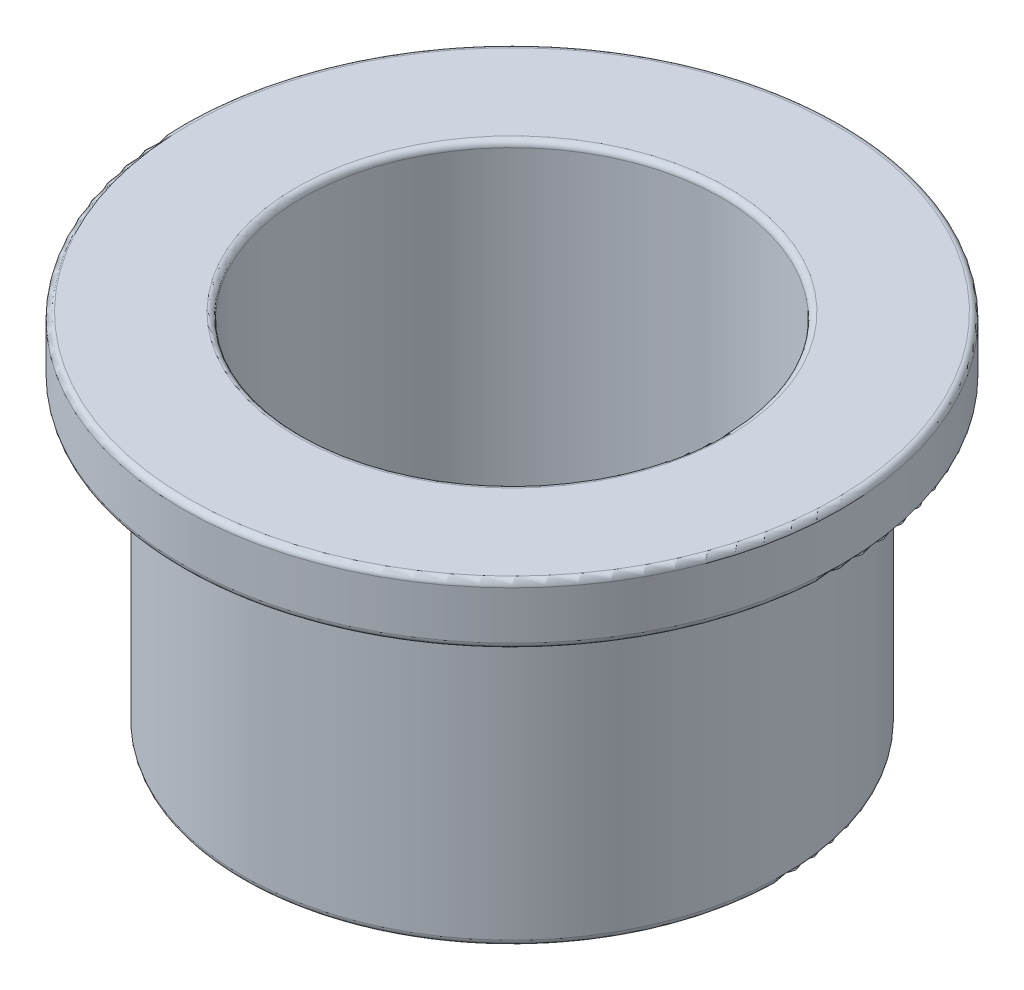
ISO-10303-21;
HEADER;
FILE_DESCRIPTION(('STEP AP214'),'2;1');
FILE_NAME('part.step','',(''),(''),'','','');
FILE_SCHEMA(('AUTOMOTIVE_DESIGN { 1 0 10303 214 1 1 1 1 }'));
ENDSEC;
DATA;
#1=APPLICATION_CONTEXT('core data for automotive mechanical design processes');
#2=APPLICATION_PROTOCOL_DEFINITION('international standard','automotive_design',2000,#1);
#3=PRODUCT_CONTEXT('',#1,'mechanical');
#4=PRODUCT('Part','Part','',(#3));
#5=PRODUCT_RELATED_PRODUCT_CATEGORY('part','',(#4));
#6=PRODUCT_DEFINITION_FORMATION('','',#4);
#7=PRODUCT_DEFINITION_CONTEXT('part definition',#1,'design');
#8=PRODUCT_DEFINITION('design','',#6,#7);
#9=PRODUCT_DEFINITION_SHAPE('','',#8);
#10=(LENGTH_UNIT() NAMED_UNIT(*) SI_UNIT(.MILLI.,.METRE.));
#11=(NAMED_UNIT(*) PLANE_ANGLE_UNIT() SI_UNIT($,.RADIAN.));
#12=(NAMED_UNIT(*) SI_UNIT($,.STERADIAN.) SOLID_ANGLE_UNIT());
#13=UNCERTAINTY_MEASURE_WITH_UNIT(LENGTH_MEASURE(1.E-05),#10,'distance_accuracy_value','');
#14=(GEOMETRIC_REPRESENTATION_CONTEXT(3) GLOBAL_UNCERTAINTY_ASSIGNED_CONTEXT((#13)) GLOBAL_UNIT_ASSIGNED_CONTEXT((#10,
#11,#12)) REPRESENTATION_CONTEXT('',''));
#15=CARTESIAN_POINT('',(0.,0.,0.));
#16=DIRECTION('',(0.,0.,1.));
#17=DIRECTION('',(1.,0.,0.));
#18=AXIS2_PLACEMENT_3D('',#15,#16,#17);
#19=CARTESIAN_POINT('',(9.,0.,0.));
#20=DIRECTION('',(0.,-1.,0.));
#21=DIRECTION('',(0.,0.,-1.));
#22=AXIS2_PLACEMENT_3D('',#19,#20,#21);
#23=PLANE('',#22);
#24=CARTESIAN_POINT('',(0.,0.,0.));
#25=DIRECTION('',(0.,-1.,0.));
#26=DIRECTION('',(0.,0.,-1.));
#27=AXIS2_PLACEMENT_3D('',#24,#25,#26);
#28=CIRCLE('',#27,7.2);
#29=CARTESIAN_POINT('',(0.,0.,-7.2));
#30=VERTEX_POINT('',#29);
#31=EDGE_CURVE('E61',#30,#30,#28,.F.);
#32=ORIENTED_EDGE('',*,*,#31,.T.);
#33=EDGE_LOOP('',(#32));
#34=FACE_BOUND('',#33,.T.);
#35=CARTESIAN_POINT('',(0.,0.,0.));
#36=DIRECTION('',(0.,-1.,0.));
#37=DIRECTION('',(0.,0.,-1.));
#38=AXIS2_PLACEMENT_3D('',#35,#36,#37);
#39=CIRCLE('',#38,8.8);
#40=CARTESIAN_POINT('',(0.,0.,-8.8));
#41=VERTEX_POINT('',#40);
#42=EDGE_CURVE('E64',#41,#41,#39,.T.);
#43=ORIENTED_EDGE('',*,*,#42,.T.);
#44=EDGE_LOOP('',(#43));
#45=FACE_BOUND('',#44,.T.);
#46=ADVANCED_FACE('F30',(#34,#45),#23,.T.);
#47=CARTESIAN_POINT('',(0.,0.,0.));
#48=DIRECTION('',(0.,-1.,0.));
#49=DIRECTION('',(0.,0.,-1.));
#50=AXIS2_PLACEMENT_3D('',#47,#48,#49);
#51=CYLINDRICAL_SURFACE('',#50,7.);
#52=CARTESIAN_POINT('',(0.,0.199999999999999,0.));
#53=DIRECTION('',(0.,-1.,0.));
#54=DIRECTION('',(0.,0.,-1.));
#55=AXIS2_PLACEMENT_3D('',#52,#53,#54);
#56=CIRCLE('',#55,7.);
#57=CARTESIAN_POINT('',(0.,0.199999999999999,-7.));
#58=VERTEX_POINT('',#57);
#59=EDGE_CURVE('E67',#58,#58,#56,.T.);
#60=ORIENTED_EDGE('',*,*,#59,.T.);
#61=EDGE_LOOP('',(#60));
#62=FACE_BOUND('',#61,.T.);
#63=CARTESIAN_POINT('',(0.,11.8,0.));
#64=DIRECTION('',(0.,1.,0.));
#65=DIRECTION('',(0.,0.,1.));
#66=AXIS2_PLACEMENT_3D('',#63,#64,#65);
#67=CIRCLE('',#66,7.);
#68=CARTESIAN_POINT('',(0.,11.8,7.));
#69=VERTEX_POINT('',#68);
#70=EDGE_CURVE('E70',#69,#69,#67,.T.);
#71=ORIENTED_EDGE('',*,*,#70,.T.);
#72=EDGE_LOOP('',(#71));
#73=FACE_BOUND('',#72,.T.);
#74=ADVANCED_FACE('F74',(#62,#73),#51,.F.);
#75=CARTESIAN_POINT('',(7.,12.,0.));
#76=DIRECTION('',(0.,1.,0.));
#77=DIRECTION('',(0.,0.,1.));
#78=AXIS2_PLACEMENT_3D('',#75,#76,#77);
#79=PLANE('',#78);
#80=CARTESIAN_POINT('',(0.,12.,0.));
#81=DIRECTION('',(0.,1.,0.));
#82=DIRECTION('',(0.,0.,1.));
#83=AXIS2_PLACEMENT_3D('',#80,#81,#82);
#84=CIRCLE('',#83,7.2);
#85=CARTESIAN_POINT('',(0.,12.,7.2));
#86=VERTEX_POINT('',#85);
#87=EDGE_CURVE('E40',#86,#86,#84,.F.);
#88=ORIENTED_EDGE('',*,*,#87,.T.);
#89=EDGE_LOOP('',(#88));
#90=FACE_BOUND('',#89,.T.);
#91=CARTESIAN_POINT('',(0.,12.,0.));
#92=DIRECTION('',(0.,1.,0.));
#93=DIRECTION('',(0.,0.,1.));
#94=AXIS2_PLACEMENT_3D('',#91,#92,#93);
#95=CIRCLE('',#94,10.8);
#96=CARTESIAN_POINT('',(0.,12.,10.8));
#97=VERTEX_POINT('',#96);
#98=EDGE_CURVE('E44',#97,#97,#95,.T.);
#99=ORIENTED_EDGE('',*,*,#98,.T.);
#100=EDGE_LOOP('',(#99));
#101=FACE_BOUND('',#100,.T.);
#102=ADVANCED_FACE('F84',(#90,#101),#79,.T.);
#103=CARTESIAN_POINT('',(0.,0.,0.));
#104=DIRECTION('',(0.,-1.,0.));
#105=DIRECTION('',(0.,0.,-1.));
#106=AXIS2_PLACEMENT_3D('',#103,#104,#105);
#107=CYLINDRICAL_SURFACE('',#106,11.);
#108=CARTESIAN_POINT('',(0.,10.2,0.));
#109=DIRECTION('',(0.,-1.,0.));
#110=DIRECTION('',(0.,0.,-1.));
#111=AXIS2_PLACEMENT_3D('',#108,#109,#110);
#112=CIRCLE('',#111,11.);
#113=CARTESIAN_POINT('',(0.,10.2,-11.));
#114=VERTEX_POINT('',#113);
#115=EDGE_CURVE('E10',#114,#114,#112,.F.);
#116=ORIENTED_EDGE('',*,*,#115,.T.);
#117=EDGE_LOOP('',(#116));
#118=FACE_BOUND('',#117,.T.);
#119=CARTESIAN_POINT('',(0.,11.8,0.));
#120=DIRECTION('',(0.,1.,0.));
#121=DIRECTION('',(0.,0.,1.));
#122=AXIS2_PLACEMENT_3D('',#119,#120,#121);
#123=CIRCLE('',#122,11.);
#124=CARTESIAN_POINT('',(0.,11.8,11.));
#125=VERTEX_POINT('',#124);
#126=EDGE_CURVE('E36',#125,#125,#123,.F.);
#127=ORIENTED_EDGE('',*,*,#126,.T.);
#128=EDGE_LOOP('',(#127));
#129=FACE_BOUND('',#128,.T.);
#130=ADVANCED_FACE('F87',(#118,#129),#107,.T.);
#131=CARTESIAN_POINT('',(11.,10.,0.));
#132=DIRECTION('',(0.,-1.,0.));
#133=DIRECTION('',(0.,0.,-1.));
#134=AXIS2_PLACEMENT_3D('',#131,#132,#133);
#135=PLANE('',#134);
#136=CARTESIAN_POINT('',(0.,10.,0.));
#137=DIRECTION('',(0.,-1.,0.));
#138=DIRECTION('',(0.,0.,-1.));
#139=AXIS2_PLACEMENT_3D('',#136,#137,#138);
#140=CIRCLE('',#139,9.2);
#141=CARTESIAN_POINT('',(0.,10.,-9.2));
#142=VERTEX_POINT('',#141);
#143=EDGE_CURVE('E49',#142,#142,#140,.F.);
#144=ORIENTED_EDGE('',*,*,#143,.T.);
#145=EDGE_LOOP('',(#144));
#146=FACE_BOUND('',#145,.T.);
#147=CARTESIAN_POINT('',(0.,10.,0.));
#148=DIRECTION('',(0.,-1.,0.));
#149=DIRECTION('',(0.,0.,-1.));
#150=AXIS2_PLACEMENT_3D('',#147,#148,#149);
#151=CIRCLE('',#150,10.8);
#152=CARTESIAN_POINT('',(0.,10.,-10.8));
#153=VERTEX_POINT('',#152);
#154=EDGE_CURVE('E52',#153,#153,#151,.T.);
#155=ORIENTED_EDGE('',*,*,#154,.T.);
#156=EDGE_LOOP('',(#155));
#157=FACE_BOUND('',#156,.T.);
#158=ADVANCED_FACE('F128',(#146,#157),#135,.T.);
#159=CARTESIAN_POINT('',(0.,0.,0.));
#160=DIRECTION('',(0.,-1.,0.));
#161=DIRECTION('',(0.,0.,-1.));
#162=AXIS2_PLACEMENT_3D('',#159,#160,#161);
#163=CYLINDRICAL_SURFACE('',#162,9.);
#164=CARTESIAN_POINT('',(0.,0.199999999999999,0.));
#165=DIRECTION('',(0.,-1.,0.));
#166=DIRECTION('',(0.,0.,-1.));
#167=AXIS2_PLACEMENT_3D('',#164,#165,#166);
#168=CIRCLE('',#167,9.);
#169=CARTESIAN_POINT('',(0.,0.199999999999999,-9.));
#170=VERTEX_POINT('',#169);
#171=EDGE_CURVE('E55',#170,#170,#168,.F.);
#172=ORIENTED_EDGE('',*,*,#171,.T.);
#173=EDGE_LOOP('',(#172));
#174=FACE_BOUND('',#173,.T.);
#175=CARTESIAN_POINT('',(0.,9.8,0.));
#176=DIRECTION('',(0.,-1.,0.));
#177=DIRECTION('',(0.,0.,-1.));
#178=AXIS2_PLACEMENT_3D('',#175,#176,#177);
#179=CIRCLE('',#178,9.);
#180=CARTESIAN_POINT('',(0.,9.8,-9.));
#181=VERTEX_POINT('',#180);
#182=EDGE_CURVE('E58',#181,#181,#179,.T.);
#183=ORIENTED_EDGE('',*,*,#182,.T.);
#184=EDGE_LOOP('',(#183));
#185=FACE_BOUND('',#184,.T.);
#186=ADVANCED_FACE('F121',(#174,#185),#163,.T.);
#187=CARTESIAN_POINT('',(0.,0.199999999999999,0.));
#188=DIRECTION('',(0.,-1.,0.));
#189=DIRECTION('',(0.,0.,-1.));
#190=AXIS2_PLACEMENT_3D('',#187,#188,#189);
#191=TOROIDAL_SURFACE('',#190,7.2,0.2);
#192=ORIENTED_EDGE('',*,*,#31,.F.);
#193=EDGE_LOOP('',(#192));
#194=FACE_BOUND('',#193,.T.);
#195=ORIENTED_EDGE('',*,*,#59,.F.);
#196=EDGE_LOOP('',(#195));
#197=FACE_BOUND('',#196,.T.);
#198=ADVANCED_FACE('F112',(#194,#197),#191,.T.);
#199=CARTESIAN_POINT('',(0.,0.199999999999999,0.));
#200=DIRECTION('',(0.,-1.,0.));
#201=DIRECTION('',(0.,0.,-1.));
#202=AXIS2_PLACEMENT_3D('',#199,#200,#201);
#203=TOROIDAL_SURFACE('',#202,8.8,0.2);
#204=ORIENTED_EDGE('',*,*,#171,.F.);
#205=EDGE_LOOP('',(#204));
#206=FACE_BOUND('',#205,.T.);
#207=ORIENTED_EDGE('',*,*,#42,.F.);
#208=EDGE_LOOP('',(#207));
#209=FACE_BOUND('',#208,.T.);
#210=ADVANCED_FACE('F110',(#206,#209),#203,.T.);
#211=CARTESIAN_POINT('',(0.,9.8,0.));
#212=DIRECTION('',(0.,-1.,0.));
#213=DIRECTION('',(0.,0.,-1.));
#214=AXIS2_PLACEMENT_3D('',#211,#212,#213);
#215=TOROIDAL_SURFACE('',#214,9.2,0.2);
#216=ORIENTED_EDGE('',*,*,#143,.F.);
#217=EDGE_LOOP('',(#216));
#218=FACE_BOUND('',#217,.T.);
#219=ORIENTED_EDGE('',*,*,#182,.F.);
#220=EDGE_LOOP('',(#219));
#221=FACE_BOUND('',#220,.T.);
#222=ADVANCED_FACE('F80',(#218,#221),#215,.F.);
#223=CARTESIAN_POINT('',(0.,11.8,0.));
#224=DIRECTION('',(0.,1.,0.));
#225=DIRECTION('',(0.,0.,1.));
#226=AXIS2_PLACEMENT_3D('',#223,#224,#225);
#227=TOROIDAL_SURFACE('',#226,7.2,0.2);
#228=ORIENTED_EDGE('',*,*,#70,.F.);
#229=EDGE_LOOP('',(#228));
#230=FACE_BOUND('',#229,.T.);
#231=ORIENTED_EDGE('',*,*,#87,.F.);
#232=EDGE_LOOP('',(#231));
#233=FACE_BOUND('',#232,.T.);
#234=ADVANCED_FACE('F76',(#230,#233),#227,.T.);
#235=CARTESIAN_POINT('',(0.,10.2,0.));
#236=DIRECTION('',(0.,-1.,0.));
#237=DIRECTION('',(0.,0.,-1.));
#238=AXIS2_PLACEMENT_3D('',#235,#236,#237);
#239=TOROIDAL_SURFACE('',#238,10.8,0.2);
#240=ORIENTED_EDGE('',*,*,#115,.F.);
#241=EDGE_LOOP('',(#240));
#242=FACE_BOUND('',#241,.T.);
#243=ORIENTED_EDGE('',*,*,#154,.F.);
#244=EDGE_LOOP('',(#243));
#245=FACE_BOUND('',#244,.T.);
#246=ADVANCED_FACE('F79',(#242,#245),#239,.T.);
#247=CARTESIAN_POINT('',(0.,11.8,0.));
#248=DIRECTION('',(0.,1.,0.));
#249=DIRECTION('',(0.,0.,1.));
#250=AXIS2_PLACEMENT_3D('',#247,#248,#249);
#251=TOROIDAL_SURFACE('',#250,10.8,0.2);
#252=ORIENTED_EDGE('',*,*,#98,.F.);
#253=EDGE_LOOP('',(#252));
#254=FACE_BOUND('',#253,.T.);
#255=ORIENTED_EDGE('',*,*,#126,.F.);
#256=EDGE_LOOP('',(#255));
#257=FACE_BOUND('',#256,.T.);
#258=ADVANCED_FACE('F91',(#254,#257),#251,.T.);
#259=CLOSED_SHELL('',(#46,#74,#102,#130,#158,#186,#198,#210,#222,#234,#246,#258));
#260=MANIFOLD_SOLID_BREP('B2',#259);
#261=ADVANCED_BREP_SHAPE_REPRESENTATION('',(#18,#260),#14);
#262=SHAPE_DEFINITION_REPRESENTATION(#9,#261);
ENDSEC;
END-ISO-10303-21;
